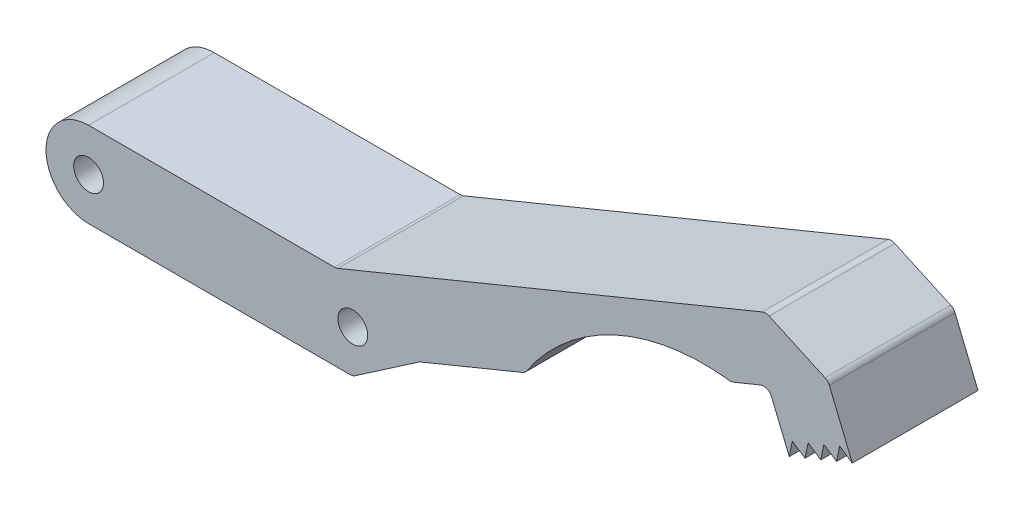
ISO-10303-21;
HEADER;
FILE_DESCRIPTION(('STEP AP214'),'2;1');
FILE_NAME('part.step','',(''),(''),'','','');
FILE_SCHEMA(('AUTOMOTIVE_DESIGN { 1 0 10303 214 1 1 1 1 }'));
ENDSEC;
DATA;
#1=APPLICATION_CONTEXT('core data for automotive mechanical design processes');
#2=APPLICATION_PROTOCOL_DEFINITION('international standard','automotive_design',2000,#1);
#3=PRODUCT_CONTEXT('',#1,'mechanical');
#4=PRODUCT('Part','Part','',(#3));
#5=PRODUCT_RELATED_PRODUCT_CATEGORY('part','',(#4));
#6=PRODUCT_DEFINITION_FORMATION('','',#4);
#7=PRODUCT_DEFINITION_CONTEXT('part definition',#1,'design');
#8=PRODUCT_DEFINITION('design','',#6,#7);
#9=PRODUCT_DEFINITION_SHAPE('','',#8);
#10=(LENGTH_UNIT() NAMED_UNIT(*) SI_UNIT(.MILLI.,.METRE.));
#11=(NAMED_UNIT(*) PLANE_ANGLE_UNIT() SI_UNIT($,.RADIAN.));
#12=(NAMED_UNIT(*) SI_UNIT($,.STERADIAN.) SOLID_ANGLE_UNIT());
#13=UNCERTAINTY_MEASURE_WITH_UNIT(LENGTH_MEASURE(1.E-05),#10,'distance_accuracy_value','');
#14=(GEOMETRIC_REPRESENTATION_CONTEXT(3) GLOBAL_UNCERTAINTY_ASSIGNED_CONTEXT((#13)) GLOBAL_UNIT_ASSIGNED_CONTEXT((#10,
#11,#12)) REPRESENTATION_CONTEXT('',''));
#15=CARTESIAN_POINT('',(0.,0.,0.));
#16=DIRECTION('',(0.,0.,1.));
#17=DIRECTION('',(1.,0.,0.));
#18=AXIS2_PLACEMENT_3D('',#15,#16,#17);
#19=CARTESIAN_POINT('',(4.18285581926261,-10.1735590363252,7.375));
#20=DIRECTION('',(0.380263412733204,-0.92487822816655,0.));
#21=DIRECTION('',(0.92487822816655,0.380263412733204,0.));
#22=AXIS2_PLACEMENT_3D('',#19,#20,#21);
#23=PLANE('',#22);
#24=DIRECTION('',(-0.92487822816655,-0.380263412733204,0.));
#25=VECTOR('',#24,1.);
#26=CARTESIAN_POINT('',(4.18285581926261,-10.1735590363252,-7.375));
#27=LINE('',#26,#25);
#28=CARTESIAN_POINT('',(41.9373455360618,5.34918835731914,-7.375));
#29=VERTEX_POINT('',#28);
#30=CARTESIAN_POINT('',(29.9516692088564,0.421281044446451,-7.375));
#31=VERTEX_POINT('',#30);
#32=EDGE_CURVE('E300',#29,#31,#27,.T.);
#33=ORIENTED_EDGE('',*,*,#32,.F.);
#34=DIRECTION('',(0.,0.,1.));
#35=VECTOR('',#34,1.);
#36=CARTESIAN_POINT('',(41.9373455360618,5.34918835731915,7.375));
#37=LINE('',#36,#35);
#38=CARTESIAN_POINT('',(41.9373455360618,5.34918835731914,7.375));
#39=VERTEX_POINT('',#38);
#40=EDGE_CURVE('E409',#29,#39,#37,.T.);
#41=ORIENTED_EDGE('',*,*,#40,.T.);
#42=DIRECTION('',(-0.92487822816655,-0.380263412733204,0.));
#43=VECTOR('',#42,1.);
#44=CARTESIAN_POINT('',(4.18285581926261,-10.1735590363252,7.375));
#45=LINE('',#44,#43);
#46=CARTESIAN_POINT('',(29.9516692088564,0.421281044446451,7.375));
#47=VERTEX_POINT('',#46);
#48=EDGE_CURVE('E449',#39,#47,#45,.T.);
#49=ORIENTED_EDGE('',*,*,#48,.T.);
#50=DIRECTION('',(0.,0.,-1.));
#51=VECTOR('',#50,1.);
#52=CARTESIAN_POINT('',(29.9516692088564,0.421281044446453,-7.375));
#53=LINE('',#52,#51);
#54=EDGE_CURVE('E406',#47,#31,#53,.T.);
#55=ORIENTED_EDGE('',*,*,#54,.T.);
#56=EDGE_LOOP('',(#33,#41,#49,#55));
#57=FACE_BOUND('',#56,.T.);
#58=ADVANCED_FACE('F41',(#57),#23,.T.);
#59=CARTESIAN_POINT('',(63.1527344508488,-8.10069108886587,7.375));
#60=DIRECTION('',(0.,0.,-1.));
#61=DIRECTION('',(-1.,0.,0.));
#62=AXIS2_PLACEMENT_3D('',#59,#60,#61);
#63=CYLINDRICAL_SURFACE('',#62,24.9423564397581);
#64=CARTESIAN_POINT('',(63.1527344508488,-8.10069108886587,-7.375));
#65=DIRECTION('',(0.,0.,1.));
#66=DIRECTION('',(1.,0.,0.));
#67=AXIS2_PLACEMENT_3D('',#64,#65,#66);
#68=CIRCLE('',#67,24.9423564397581);
#69=CARTESIAN_POINT('',(42.3895297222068,5.71996280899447,-7.375));
#70=VERTEX_POINT('',#69);
#71=CARTESIAN_POINT('',(66.1728326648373,16.6581487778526,-7.375));
#72=VERTEX_POINT('',#71);
#73=EDGE_CURVE('E303',#70,#72,#68,.F.);
#74=ORIENTED_EDGE('',*,*,#73,.T.);
#75=DIRECTION('',(0.,0.,-1.));
#76=VECTOR('',#75,1.);
#77=CARTESIAN_POINT('',(66.1728326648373,16.6581487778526,7.375));
#78=LINE('',#77,#76);
#79=CARTESIAN_POINT('',(66.1728326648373,16.6581487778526,7.375));
#80=VERTEX_POINT('',#79);
#81=EDGE_CURVE('E393',#72,#80,#78,.F.);
#82=ORIENTED_EDGE('',*,*,#81,.T.);
#83=CARTESIAN_POINT('',(63.1527344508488,-8.10069108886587,7.375));
#84=DIRECTION('',(0.,0.,1.));
#85=DIRECTION('',(1.,0.,0.));
#86=AXIS2_PLACEMENT_3D('',#83,#84,#85);
#87=CIRCLE('',#86,24.9423564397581);
#88=CARTESIAN_POINT('',(42.3895297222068,5.71996280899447,7.375));
#89=VERTEX_POINT('',#88);
#90=EDGE_CURVE('E252',#89,#80,#87,.F.);
#91=ORIENTED_EDGE('',*,*,#90,.F.);
#92=DIRECTION('',(0.,0.,-1.));
#93=VECTOR('',#92,1.);
#94=CARTESIAN_POINT('',(42.3895297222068,5.71996280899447,7.375));
#95=LINE('',#94,#93);
#96=EDGE_CURVE('E390',#89,#70,#95,.T.);
#97=ORIENTED_EDGE('',*,*,#96,.T.);
#98=EDGE_LOOP('',(#74,#82,#91,#97));
#99=FACE_BOUND('',#98,.T.);
#100=ADVANCED_FACE('F488',(#99),#63,.F.);
#101=CARTESIAN_POINT('',(3.75864457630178,-9.14179071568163,7.375));
#102=DIRECTION('',(0.380263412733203,-0.924878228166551,0.));
#103=DIRECTION('',(0.924878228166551,0.380263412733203,0.));
#104=AXIS2_PLACEMENT_3D('',#101,#102,#103);
#105=PLANE('',#104);
#106=DIRECTION('',(-0.924878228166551,-0.380263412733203,0.));
#107=VECTOR('',#106,1.);
#108=CARTESIAN_POINT('',(3.75864457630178,-9.14179071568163,7.375));
#109=LINE('',#108,#107);
#110=CARTESIAN_POINT('',(69.8366856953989,18.0261765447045,7.375));
#111=VERTEX_POINT('',#110);
#112=CARTESIAN_POINT('',(66.6741791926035,16.7259129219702,7.375));
#113=VERTEX_POINT('',#112);
#114=EDGE_CURVE('E249',#111,#113,#109,.T.);
#115=ORIENTED_EDGE('',*,*,#114,.T.);
#116=DIRECTION('',(0.,0.,1.));
#117=VECTOR('',#116,1.);
#118=CARTESIAN_POINT('',(66.6741791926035,16.7259129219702,-7.375));
#119=LINE('',#118,#117);
#120=CARTESIAN_POINT('',(66.6741791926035,16.7259129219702,-7.375));
#121=VERTEX_POINT('',#120);
#122=EDGE_CURVE('E377',#113,#121,#119,.F.);
#123=ORIENTED_EDGE('',*,*,#122,.T.);
#124=DIRECTION('',(-0.924878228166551,-0.380263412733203,0.));
#125=VECTOR('',#124,1.);
#126=CARTESIAN_POINT('',(3.75864457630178,-9.14179071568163,-7.375));
#127=LINE('',#126,#125);
#128=CARTESIAN_POINT('',(69.8366856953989,18.0261765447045,-7.375));
#129=VERTEX_POINT('',#128);
#130=EDGE_CURVE('E306',#129,#121,#127,.T.);
#131=ORIENTED_EDGE('',*,*,#130,.F.);
#132=DIRECTION('',(0.,0.,-1.));
#133=VECTOR('',#132,1.);
#134=CARTESIAN_POINT('',(69.8366856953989,18.0261765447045,7.375));
#135=LINE('',#134,#133);
#136=EDGE_CURVE('E233',#129,#111,#135,.F.);
#137=ORIENTED_EDGE('',*,*,#136,.T.);
#138=EDGE_LOOP('',(#115,#123,#131,#137));
#139=FACE_BOUND('',#138,.T.);
#140=ADVANCED_FACE('F493',(#139),#105,.T.);
#141=CARTESIAN_POINT('',(67.0029193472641,27.5482306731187,7.375));
#142=DIRECTION('',(-0.924878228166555,-0.380263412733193,0.));
#143=DIRECTION('',(0.380263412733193,-0.924878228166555,0.));
#144=AXIS2_PLACEMENT_3D('',#141,#142,#143);
#145=PLANE('',#144);
#146=DIRECTION('',(-0.380263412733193,0.924878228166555,0.));
#147=VECTOR('',#146,1.);
#148=CARTESIAN_POINT('',(67.0029193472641,27.5482306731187,7.375));
#149=LINE('',#148,#147);
#150=CARTESIAN_POINT('',(73.2163573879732,12.4358812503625,7.375));
#151=VERTEX_POINT('',#150);
#152=CARTESIAN_POINT('',(71.1418273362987,17.4815617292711,7.375));
#153=VERTEX_POINT('',#152);
#154=EDGE_CURVE('E226',#151,#153,#149,.T.);
#155=ORIENTED_EDGE('',*,*,#154,.T.);
#156=DIRECTION('',(0.,0.,-1.));
#157=VECTOR('',#156,1.);
#158=CARTESIAN_POINT('',(71.1418273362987,17.4815617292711,-7.375));
#159=LINE('',#158,#157);
#160=CARTESIAN_POINT('',(71.1418273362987,17.4815617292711,-7.375));
#161=VERTEX_POINT('',#160);
#162=EDGE_CURVE('E404',#153,#161,#159,.T.);
#163=ORIENTED_EDGE('',*,*,#162,.T.);
#164=DIRECTION('',(-0.380263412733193,0.924878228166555,0.));
#165=VECTOR('',#164,1.);
#166=CARTESIAN_POINT('',(67.0029193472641,27.5482306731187,-7.375));
#167=LINE('',#166,#165);
#168=CARTESIAN_POINT('',(73.2163573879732,12.4358812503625,-7.375));
#169=VERTEX_POINT('',#168);
#170=EDGE_CURVE('E229',#169,#161,#167,.T.);
#171=ORIENTED_EDGE('',*,*,#170,.F.);
#172=DIRECTION('',(0.,0.,-1.));
#173=VECTOR('',#172,1.);
#174=CARTESIAN_POINT('',(73.2163573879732,12.4358812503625,7.375));
#175=LINE('',#174,#173);
#176=EDGE_CURVE('E221',#151,#169,#175,.T.);
#177=ORIENTED_EDGE('',*,*,#176,.F.);
#178=EDGE_LOOP('',(#155,#163,#171,#177));
#179=FACE_BOUND('',#178,.T.);
#180=ADVANCED_FACE('F223',(#179),#145,.T.);
#181=CARTESIAN_POINT('',(67.8333487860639,-13.8770907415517,7.375));
#182=DIRECTION('',(-0.979709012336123,0.200425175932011,0.));
#183=DIRECTION('',(-0.200425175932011,-0.979709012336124,0.));
#184=AXIS2_PLACEMENT_3D('',#181,#182,#183);
#185=PLANE('',#184);
#186=DIRECTION('',(0.200425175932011,0.979709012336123,0.));
#187=VECTOR('',#186,1.);
#188=CARTESIAN_POINT('',(67.8333487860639,-13.8770907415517,-7.375));
#189=LINE('',#188,#187);
#190=CARTESIAN_POINT('',(73.575596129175,14.1918953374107,-7.375));
#191=VERTEX_POINT('',#190);
#192=EDGE_CURVE('E310',#169,#191,#189,.T.);
#193=ORIENTED_EDGE('',*,*,#192,.T.);
#194=DIRECTION('',(0.,0.,-1.));
#195=VECTOR('',#194,1.);
#196=CARTESIAN_POINT('',(73.575596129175,14.1918953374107,7.375));
#197=LINE('',#196,#195);
#198=CARTESIAN_POINT('',(73.575596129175,14.1918953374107,7.375));
#199=VERTEX_POINT('',#198);
#200=EDGE_CURVE('E234',#199,#191,#197,.T.);
#201=ORIENTED_EDGE('',*,*,#200,.F.);
#202=DIRECTION('',(0.200425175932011,0.979709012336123,0.));
#203=VECTOR('',#202,1.);
#204=CARTESIAN_POINT('',(67.8333487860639,-13.8770907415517,7.375));
#205=LINE('',#204,#203);
#206=EDGE_CURVE('E238',#151,#199,#205,.T.);
#207=ORIENTED_EDGE('',*,*,#206,.F.);
#208=ORIENTED_EDGE('',*,*,#176,.T.);
#209=EDGE_LOOP('',(#193,#201,#207,#208));
#210=FACE_BOUND('',#209,.T.);
#211=ADVANCED_FACE('F239',(#210),#185,.F.);
#212=CARTESIAN_POINT('',(29.2503710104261,43.7958353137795,7.375));
#213=DIRECTION('',(0.555398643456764,0.831584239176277,0.));
#214=DIRECTION('',(-0.831584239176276,0.555398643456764,0.));
#215=AXIS2_PLACEMENT_3D('',#212,#213,#214);
#216=PLANE('',#215);
#217=DIRECTION('',(0.831584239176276,-0.555398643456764,0.));
#218=VECTOR('',#217,1.);
#219=CARTESIAN_POINT('',(29.2503710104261,43.7958353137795,-7.375));
#220=LINE('',#219,#218);
#221=CARTESIAN_POINT('',(75.0661138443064,13.1964080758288,-7.375));
#222=VERTEX_POINT('',#221);
#223=EDGE_CURVE('E312',#191,#222,#220,.T.);
#224=ORIENTED_EDGE('',*,*,#223,.T.);
#225=DIRECTION('',(0.,0.,-1.));
#226=VECTOR('',#225,1.);
#227=CARTESIAN_POINT('',(75.0661138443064,13.1964080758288,7.375));
#228=LINE('',#227,#226);
#229=CARTESIAN_POINT('',(75.0661138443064,13.1964080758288,7.375));
#230=VERTEX_POINT('',#229);
#231=EDGE_CURVE('E372',#230,#222,#228,.T.);
#232=ORIENTED_EDGE('',*,*,#231,.F.);
#233=DIRECTION('',(0.831584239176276,-0.555398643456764,0.));
#234=VECTOR('',#233,1.);
#235=CARTESIAN_POINT('',(29.2503710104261,43.7958353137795,7.375));
#236=LINE('',#235,#234);
#237=EDGE_CURVE('E242',#199,#230,#236,.T.);
#238=ORIENTED_EDGE('',*,*,#237,.F.);
#239=ORIENTED_EDGE('',*,*,#200,.T.);
#240=EDGE_LOOP('',(#224,#232,#238,#239));
#241=FACE_BOUND('',#240,.T.);
#242=ADVANCED_FACE('F581',(#241),#216,.F.);
#243=CARTESIAN_POINT('',(69.4594642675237,-14.2097553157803,7.375));
#244=DIRECTION('',(-0.979709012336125,0.200425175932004,0.));
#245=DIRECTION('',(-0.200425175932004,-0.979709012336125,0.));
#246=AXIS2_PLACEMENT_3D('',#243,#244,#245);
#247=PLANE('',#246);
#248=DIRECTION('',(0.200425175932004,0.979709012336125,0.));
#249=VECTOR('',#248,1.);
#250=CARTESIAN_POINT('',(69.4594642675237,-14.2097553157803,-7.375));
#251=LINE('',#250,#249);
#252=CARTESIAN_POINT('',(75.4253525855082,14.952422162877,-7.375));
#253=VERTEX_POINT('',#252);
#254=EDGE_CURVE('E315',#222,#253,#251,.T.);
#255=ORIENTED_EDGE('',*,*,#254,.T.);
#256=DIRECTION('',(0.,0.,-1.));
#257=VECTOR('',#256,1.);
#258=CARTESIAN_POINT('',(75.4253525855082,14.952422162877,7.375));
#259=LINE('',#258,#257);
#260=CARTESIAN_POINT('',(75.4253525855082,14.952422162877,7.375));
#261=VERTEX_POINT('',#260);
#262=EDGE_CURVE('E370',#261,#253,#259,.T.);
#263=ORIENTED_EDGE('',*,*,#262,.F.);
#264=DIRECTION('',(0.200425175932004,0.979709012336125,0.));
#265=VECTOR('',#264,1.);
#266=CARTESIAN_POINT('',(69.4594642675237,-14.2097553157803,7.375));
#267=LINE('',#266,#265);
#268=EDGE_CURVE('E257',#230,#261,#267,.T.);
#269=ORIENTED_EDGE('',*,*,#268,.F.);
#270=ORIENTED_EDGE('',*,*,#231,.T.);
#271=EDGE_LOOP('',(#255,#263,#269,#270));
#272=FACE_BOUND('',#271,.T.);
#273=ADVANCED_FACE('F578',(#272),#247,.F.);
#274=CARTESIAN_POINT('',(30.1722185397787,45.1760941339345,7.375));
#275=DIRECTION('',(-0.555398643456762,-0.831584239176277,0.));
#276=DIRECTION('',(0.831584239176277,-0.555398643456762,0.));
#277=AXIS2_PLACEMENT_3D('',#274,#275,#276);
#278=PLANE('',#277);
#279=DIRECTION('',(-0.831584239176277,0.555398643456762,0.));
#280=VECTOR('',#279,1.);
#281=CARTESIAN_POINT('',(30.1722185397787,45.1760941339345,-7.375));
#282=LINE('',#281,#280);
#283=CARTESIAN_POINT('',(76.9158703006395,13.9569349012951,-7.375));
#284=VERTEX_POINT('',#283);
#285=EDGE_CURVE('E318',#284,#253,#282,.T.);
#286=ORIENTED_EDGE('',*,*,#285,.F.);
#287=DIRECTION('',(0.,0.,-1.));
#288=VECTOR('',#287,1.);
#289=CARTESIAN_POINT('',(76.9158703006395,13.9569349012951,7.375));
#290=LINE('',#289,#288);
#291=CARTESIAN_POINT('',(76.9158703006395,13.9569349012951,7.375));
#292=VERTEX_POINT('',#291);
#293=EDGE_CURVE('E368',#292,#284,#290,.T.);
#294=ORIENTED_EDGE('',*,*,#293,.F.);
#295=DIRECTION('',(-0.831584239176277,0.555398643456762,0.));
#296=VECTOR('',#295,1.);
#297=CARTESIAN_POINT('',(30.1722185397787,45.1760941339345,7.375));
#298=LINE('',#297,#296);
#299=EDGE_CURVE('E259',#292,#261,#298,.T.);
#300=ORIENTED_EDGE('',*,*,#299,.T.);
#301=ORIENTED_EDGE('',*,*,#262,.T.);
#302=EDGE_LOOP('',(#286,#294,#300,#301));
#303=FACE_BOUND('',#302,.T.);
#304=ADVANCED_FACE('F575',(#303),#278,.T.);
#305=CARTESIAN_POINT('',(71.0855797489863,-14.5424198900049,7.375));
#306=DIRECTION('',(0.979709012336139,-0.200425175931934,0.));
#307=DIRECTION('',(0.200425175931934,0.979709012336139,0.));
#308=AXIS2_PLACEMENT_3D('',#305,#306,#307);
#309=PLANE('',#308);
#310=DIRECTION('',(-0.200425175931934,-0.979709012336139,0.));
#311=VECTOR('',#310,1.);
#312=CARTESIAN_POINT('',(71.0855797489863,-14.5424198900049,-7.375));
#313=LINE('',#312,#311);
#314=CARTESIAN_POINT('',(77.2751090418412,15.7129489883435,-7.375));
#315=VERTEX_POINT('',#314);
#316=EDGE_CURVE('E321',#315,#284,#313,.T.);
#317=ORIENTED_EDGE('',*,*,#316,.F.);
#318=DIRECTION('',(0.,0.,-1.));
#319=VECTOR('',#318,1.);
#320=CARTESIAN_POINT('',(77.2751090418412,15.7129489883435,7.375));
#321=LINE('',#320,#319);
#322=CARTESIAN_POINT('',(77.2751090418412,15.7129489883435,7.375));
#323=VERTEX_POINT('',#322);
#324=EDGE_CURVE('E366',#323,#315,#321,.T.);
#325=ORIENTED_EDGE('',*,*,#324,.F.);
#326=DIRECTION('',(-0.200425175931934,-0.979709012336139,0.));
#327=VECTOR('',#326,1.);
#328=CARTESIAN_POINT('',(71.0855797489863,-14.5424198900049,7.375));
#329=LINE('',#328,#327);
#330=EDGE_CURVE('E262',#323,#292,#329,.T.);
#331=ORIENTED_EDGE('',*,*,#330,.T.);
#332=ORIENTED_EDGE('',*,*,#293,.T.);
#333=EDGE_LOOP('',(#317,#325,#331,#332));
#334=FACE_BOUND('',#333,.T.);
#335=ADVANCED_FACE('F571',(#334),#309,.T.);
#336=CARTESIAN_POINT('',(31.0940660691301,46.5563529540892,7.375));
#337=DIRECTION('',(-0.555398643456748,-0.831584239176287,0.));
#338=DIRECTION('',(0.831584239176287,-0.555398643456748,0.));
#339=AXIS2_PLACEMENT_3D('',#336,#337,#338);
#340=PLANE('',#339);
#341=DIRECTION('',(-0.831584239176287,0.555398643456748,0.));
#342=VECTOR('',#341,1.);
#343=CARTESIAN_POINT('',(31.0940660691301,46.5563529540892,-7.375));
#344=LINE('',#343,#342);
#345=CARTESIAN_POINT('',(78.7656267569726,14.7174617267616,-7.375));
#346=VERTEX_POINT('',#345);
#347=EDGE_CURVE('E324',#346,#315,#344,.T.);
#348=ORIENTED_EDGE('',*,*,#347,.F.);
#349=DIRECTION('',(0.,0.,-1.));
#350=VECTOR('',#349,1.);
#351=CARTESIAN_POINT('',(78.7656267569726,14.7174617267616,7.375));
#352=LINE('',#351,#350);
#353=CARTESIAN_POINT('',(78.7656267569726,14.7174617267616,7.375));
#354=VERTEX_POINT('',#353);
#355=EDGE_CURVE('E364',#354,#346,#352,.T.);
#356=ORIENTED_EDGE('',*,*,#355,.F.);
#357=DIRECTION('',(-0.831584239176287,0.555398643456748,0.));
#358=VECTOR('',#357,1.);
#359=CARTESIAN_POINT('',(31.0940660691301,46.5563529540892,7.375));
#360=LINE('',#359,#358);
#361=EDGE_CURVE('E265',#354,#323,#360,.T.);
#362=ORIENTED_EDGE('',*,*,#361,.T.);
#363=ORIENTED_EDGE('',*,*,#324,.T.);
#364=EDGE_LOOP('',(#348,#356,#362,#363));
#365=FACE_BOUND('',#364,.T.);
#366=ADVANCED_FACE('F567',(#365),#340,.T.);
#367=CARTESIAN_POINT('',(72.7116952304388,-14.8750844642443,7.375));
#368=DIRECTION('',(0.979709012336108,-0.200425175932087,0.));
#369=DIRECTION('',(0.200425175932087,0.979709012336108,0.));
#370=AXIS2_PLACEMENT_3D('',#367,#368,#369);
#371=PLANE('',#370);
#372=DIRECTION('',(-0.200425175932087,-0.979709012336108,0.));
#373=VECTOR('',#372,1.);
#374=CARTESIAN_POINT('',(72.7116952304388,-14.8750844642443,-7.375));
#375=LINE('',#374,#373);
#376=CARTESIAN_POINT('',(79.1248654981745,16.4734758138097,-7.375));
#377=VERTEX_POINT('',#376);
#378=EDGE_CURVE('E327',#377,#346,#375,.T.);
#379=ORIENTED_EDGE('',*,*,#378,.F.);
#380=DIRECTION('',(0.,0.,-1.));
#381=VECTOR('',#380,1.);
#382=CARTESIAN_POINT('',(79.1248654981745,16.4734758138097,7.375));
#383=LINE('',#382,#381);
#384=CARTESIAN_POINT('',(79.1248654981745,16.4734758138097,7.375));
#385=VERTEX_POINT('',#384);
#386=EDGE_CURVE('E362',#385,#377,#383,.T.);
#387=ORIENTED_EDGE('',*,*,#386,.F.);
#388=DIRECTION('',(-0.200425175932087,-0.979709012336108,0.));
#389=VECTOR('',#388,1.);
#390=CARTESIAN_POINT('',(72.7116952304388,-14.8750844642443,7.375));
#391=LINE('',#390,#389);
#392=EDGE_CURVE('E268',#385,#354,#391,.T.);
#393=ORIENTED_EDGE('',*,*,#392,.T.);
#394=ORIENTED_EDGE('',*,*,#355,.T.);
#395=EDGE_LOOP('',(#379,#387,#393,#394));
#396=FACE_BOUND('',#395,.T.);
#397=ADVANCED_FACE('F562',(#396),#371,.T.);
#398=CARTESIAN_POINT('',(32.0159135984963,47.9366117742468,7.375));
#399=DIRECTION('',(0.555398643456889,0.831584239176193,0.));
#400=DIRECTION('',(-0.831584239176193,0.555398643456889,0.));
#401=AXIS2_PLACEMENT_3D('',#398,#399,#400);
#402=PLANE('',#401);
#403=DIRECTION('',(0.831584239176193,-0.555398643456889,0.));
#404=VECTOR('',#403,1.);
#405=CARTESIAN_POINT('',(32.0159135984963,47.9366117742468,-7.375));
#406=LINE('',#405,#404);
#407=CARTESIAN_POINT('',(80.6153832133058,15.4779885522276,-7.375));
#408=VERTEX_POINT('',#407);
#409=EDGE_CURVE('E330',#377,#408,#406,.T.);
#410=ORIENTED_EDGE('',*,*,#409,.T.);
#411=DIRECTION('',(0.,0.,-1.));
#412=VECTOR('',#411,1.);
#413=CARTESIAN_POINT('',(80.6153832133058,15.4779885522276,7.375));
#414=LINE('',#413,#412);
#415=CARTESIAN_POINT('',(80.6153832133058,15.4779885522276,7.375));
#416=VERTEX_POINT('',#415);
#417=EDGE_CURVE('E359',#416,#408,#414,.T.);
#418=ORIENTED_EDGE('',*,*,#417,.F.);
#419=DIRECTION('',(0.831584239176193,-0.555398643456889,0.));
#420=VECTOR('',#419,1.);
#421=CARTESIAN_POINT('',(32.0159135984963,47.9366117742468,7.375));
#422=LINE('',#421,#420);
#423=EDGE_CURVE('E271',#385,#416,#422,.T.);
#424=ORIENTED_EDGE('',*,*,#423,.F.);
#425=ORIENTED_EDGE('',*,*,#386,.T.);
#426=EDGE_LOOP('',(#410,#418,#424,#425));
#427=FACE_BOUND('',#426,.T.);
#428=ADVANCED_FACE('F559',(#427),#402,.F.);
#429=CARTESIAN_POINT('',(74.4019451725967,30.5903379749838,7.375));
#430=DIRECTION('',(-0.924878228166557,-0.380263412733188,0.));
#431=DIRECTION('',(0.380263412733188,-0.924878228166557,0.));
#432=AXIS2_PLACEMENT_3D('',#429,#430,#431);
#433=PLANE('',#432);
#434=DIRECTION('',(-0.380263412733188,0.924878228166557,0.));
#435=VECTOR('',#434,1.);
#436=CARTESIAN_POINT('',(74.4019451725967,30.5903379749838,-7.375));
#437=LINE('',#436,#435);
#438=CARTESIAN_POINT('',(77.923325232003,22.0256229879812,-7.375));
#439=VERTEX_POINT('',#438);
#440=EDGE_CURVE('E333',#408,#439,#437,.T.);
#441=ORIENTED_EDGE('',*,*,#440,.T.);
#442=DIRECTION('',(0.,0.,-1.));
#443=VECTOR('',#442,1.);
#444=CARTESIAN_POINT('',(77.923325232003,22.0256229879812,7.375));
#445=LINE('',#444,#443);
#446=CARTESIAN_POINT('',(77.923325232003,22.0256229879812,7.375));
#447=VERTEX_POINT('',#446);
#448=EDGE_CURVE('E424',#439,#447,#445,.F.);
#449=ORIENTED_EDGE('',*,*,#448,.T.);
#450=DIRECTION('',(-0.380263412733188,0.924878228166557,0.));
#451=VECTOR('',#450,1.);
#452=CARTESIAN_POINT('',(74.4019451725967,30.5903379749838,7.375));
#453=LINE('',#452,#451);
#454=EDGE_CURVE('E274',#416,#447,#453,.T.);
#455=ORIENTED_EDGE('',*,*,#454,.F.);
#456=ORIENTED_EDGE('',*,*,#417,.T.);
#457=EDGE_LOOP('',(#441,#449,#455,#456));
#458=FACE_BOUND('',#457,.T.);
#459=ADVANCED_FACE('F555',(#458),#433,.F.);
#460=CARTESIAN_POINT('',(21.8103769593,47.8823439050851,7.375));
#461=DIRECTION('',(0.414522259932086,0.910039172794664,0.));
#462=DIRECTION('',(-0.910039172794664,0.414522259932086,0.));
#463=AXIS2_PLACEMENT_3D('',#460,#461,#462);
#464=PLANE('',#463);
#465=DIRECTION('',(0.910039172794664,-0.414522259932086,0.));
#466=VECTOR('',#465,1.);
#467=CARTESIAN_POINT('',(21.8103769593,47.8823439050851,7.375));
#468=LINE('',#467,#466);
#469=CARTESIAN_POINT('',(70.8500425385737,25.54480766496,7.375));
#470=VERTEX_POINT('',#469);
#471=CARTESIAN_POINT('',(77.4129692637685,22.5553987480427,7.375));
#472=VERTEX_POINT('',#471);
#473=EDGE_CURVE('E277',#470,#472,#468,.T.);
#474=ORIENTED_EDGE('',*,*,#473,.T.);
#475=DIRECTION('',(0.,0.,-1.));
#476=VECTOR('',#475,1.);
#477=CARTESIAN_POINT('',(77.4129692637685,22.5553987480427,-7.375));
#478=LINE('',#477,#476);
#479=CARTESIAN_POINT('',(77.4129692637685,22.5553987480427,-7.375));
#480=VERTEX_POINT('',#479);
#481=EDGE_CURVE('E421',#472,#480,#478,.T.);
#482=ORIENTED_EDGE('',*,*,#481,.T.);
#483=DIRECTION('',(0.910039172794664,-0.414522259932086,0.));
#484=VECTOR('',#483,1.);
#485=CARTESIAN_POINT('',(21.8103769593,47.8823439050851,-7.375));
#486=LINE('',#485,#484);
#487=CARTESIAN_POINT('',(70.8500425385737,25.54480766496,-7.375));
#488=VERTEX_POINT('',#487);
#489=EDGE_CURVE('E336',#488,#480,#486,.T.);
#490=ORIENTED_EDGE('',*,*,#489,.F.);
#491=DIRECTION('',(0.,0.,-1.));
#492=VECTOR('',#491,1.);
#493=CARTESIAN_POINT('',(70.8500425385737,25.54480766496,7.375));
#494=LINE('',#493,#492);
#495=EDGE_CURVE('E419',#488,#470,#494,.F.);
#496=ORIENTED_EDGE('',*,*,#495,.T.);
#497=EDGE_LOOP('',(#474,#482,#490,#496));
#498=FACE_BOUND('',#497,.T.);
#499=ADVANCED_FACE('F548',(#498),#464,.T.);
#500=CARTESIAN_POINT('',(1.14074851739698,-2.7745332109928,7.375));
#501=DIRECTION('',(-0.380263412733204,0.92487822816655,0.));
#502=DIRECTION('',(-0.92487822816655,-0.380263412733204,0.));
#503=AXIS2_PLACEMENT_3D('',#500,#501,#502);
#504=PLANE('',#503);
#505=DIRECTION('',(0.92487822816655,0.380263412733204,0.));
#506=VECTOR('',#505,1.);
#507=CARTESIAN_POINT('',(1.14074851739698,-2.7745332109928,-7.375));
#508=LINE('',#507,#506);
#509=CARTESIAN_POINT('',(20.2327114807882,5.07512177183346,-7.375));
#510=VERTEX_POINT('',#509);
#511=CARTESIAN_POINT('',(70.0552568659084,25.5596467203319,-7.375));
#512=VERTEX_POINT('',#511);
#513=EDGE_CURVE('E339',#510,#512,#508,.T.);
#514=ORIENTED_EDGE('',*,*,#513,.F.);
#515=DIRECTION('',(0.,0.,-1.));
#516=VECTOR('',#515,1.);
#517=CARTESIAN_POINT('',(20.2327114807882,5.07512177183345,7.375));
#518=LINE('',#517,#516);
#519=CARTESIAN_POINT('',(20.2327114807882,5.07512177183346,7.375));
#520=VERTEX_POINT('',#519);
#521=EDGE_CURVE('E417',#510,#520,#518,.F.);
#522=ORIENTED_EDGE('',*,*,#521,.T.);
#523=DIRECTION('',(0.92487822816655,0.380263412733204,0.));
#524=VECTOR('',#523,1.);
#525=CARTESIAN_POINT('',(1.14074851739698,-2.7745332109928,7.375));
#526=LINE('',#525,#524);
#527=CARTESIAN_POINT('',(70.0552568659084,25.5596467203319,7.375));
#528=VERTEX_POINT('',#527);
#529=EDGE_CURVE('E280',#520,#528,#526,.T.);
#530=ORIENTED_EDGE('',*,*,#529,.T.);
#531=DIRECTION('',(0.,0.,-1.));
#532=VECTOR('',#531,1.);
#533=CARTESIAN_POINT('',(70.0552568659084,25.5596467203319,7.375));
#534=LINE('',#533,#532);
#535=EDGE_CURVE('E414',#528,#512,#534,.T.);
#536=ORIENTED_EDGE('',*,*,#535,.T.);
#537=EDGE_LOOP('',(#514,#522,#530,#536));
#538=FACE_BOUND('',#537,.T.);
#539=ADVANCED_FACE('F541',(#538),#504,.T.);
#540=CARTESIAN_POINT('',(0.,5.,7.375));
#541=DIRECTION('',(0.,1.,0.));
#542=DIRECTION('',(-1.,0.,0.));
#543=AXIS2_PLACEMENT_3D('',#540,#541,#542);
#544=PLANE('',#543);
#545=DIRECTION('',(1.,0.,0.));
#546=VECTOR('',#545,1.);
#547=CARTESIAN_POINT('',(0.,5.,7.375));
#548=LINE('',#547,#546);
#549=CARTESIAN_POINT('',(-9.,5.,7.375));
#550=VERTEX_POINT('',#549);
#551=CARTESIAN_POINT('',(19.852448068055,5.,7.375));
#552=VERTEX_POINT('',#551);
#553=EDGE_CURVE('E283',#550,#552,#548,.T.);
#554=ORIENTED_EDGE('',*,*,#553,.T.);
#555=DIRECTION('',(0.,0.,-1.));
#556=VECTOR('',#555,1.);
#557=CARTESIAN_POINT('',(19.852448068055,5.,-7.375));
#558=LINE('',#557,#556);
#559=CARTESIAN_POINT('',(19.852448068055,5.,-7.375));
#560=VERTEX_POINT('',#559);
#561=EDGE_CURVE('E411',#552,#560,#558,.T.);
#562=ORIENTED_EDGE('',*,*,#561,.T.);
#563=DIRECTION('',(1.,0.,0.));
#564=VECTOR('',#563,1.);
#565=CARTESIAN_POINT('',(0.,5.,-7.375));
#566=LINE('',#565,#564);
#567=CARTESIAN_POINT('',(-9.,5.,-7.375));
#568=VERTEX_POINT('',#567);
#569=EDGE_CURVE('E342',#568,#560,#566,.T.);
#570=ORIENTED_EDGE('',*,*,#569,.F.);
#571=DIRECTION('',(0.,0.,-1.));
#572=VECTOR('',#571,1.);
#573=CARTESIAN_POINT('',(-9.,5.,7.375));
#574=LINE('',#573,#572);
#575=EDGE_CURVE('E357',#550,#568,#574,.T.);
#576=ORIENTED_EDGE('',*,*,#575,.F.);
#577=EDGE_LOOP('',(#554,#562,#570,#576));
#578=FACE_BOUND('',#577,.T.);
#579=ADVANCED_FACE('F534',(#578),#544,.T.);
#580=CARTESIAN_POINT('',(-9.,0.,7.375));
#581=DIRECTION('',(0.,0.,-1.));
#582=DIRECTION('',(-1.,0.,0.));
#583=AXIS2_PLACEMENT_3D('',#580,#581,#582);
#584=CYLINDRICAL_SURFACE('',#583,5.);
#585=CARTESIAN_POINT('',(-9.,0.,-7.375));
#586=DIRECTION('',(0.,0.,1.));
#587=DIRECTION('',(1.,0.,0.));
#588=AXIS2_PLACEMENT_3D('',#585,#586,#587);
#589=CIRCLE('',#588,5.);
#590=CARTESIAN_POINT('',(-9.,-5.,-7.375));
#591=VERTEX_POINT('',#590);
#592=EDGE_CURVE('E345',#568,#591,#589,.T.);
#593=ORIENTED_EDGE('',*,*,#592,.T.);
#594=DIRECTION('',(0.,0.,-1.));
#595=VECTOR('',#594,1.);
#596=CARTESIAN_POINT('',(-9.,-5.,7.375));
#597=LINE('',#596,#595);
#598=CARTESIAN_POINT('',(-9.,-5.,7.375));
#599=VERTEX_POINT('',#598);
#600=EDGE_CURVE('E293',#599,#591,#597,.T.);
#601=ORIENTED_EDGE('',*,*,#600,.F.);
#602=CARTESIAN_POINT('',(-9.,0.,7.375));
#603=DIRECTION('',(0.,0.,1.));
#604=DIRECTION('',(1.,0.,0.));
#605=AXIS2_PLACEMENT_3D('',#602,#603,#604);
#606=CIRCLE('',#605,5.);
#607=EDGE_CURVE('E286',#550,#599,#606,.T.);
#608=ORIENTED_EDGE('',*,*,#607,.F.);
#609=ORIENTED_EDGE('',*,*,#575,.T.);
#610=EDGE_LOOP('',(#593,#601,#608,#609));
#611=FACE_BOUND('',#610,.T.);
#612=ADVANCED_FACE('F531',(#611),#584,.T.);
#613=CARTESIAN_POINT('',(0.,-5.,7.375));
#614=DIRECTION('',(0.,1.,0.));
#615=DIRECTION('',(-1.,0.,0.));
#616=AXIS2_PLACEMENT_3D('',#613,#614,#615);
#617=PLANE('',#616);
#618=DIRECTION('',(1.,0.,0.));
#619=VECTOR('',#618,1.);
#620=CARTESIAN_POINT('',(0.,-5.,-7.375));
#621=LINE('',#620,#619);
#622=CARTESIAN_POINT('',(21.6902867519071,-5.,-7.375));
#623=VERTEX_POINT('',#622);
#624=EDGE_CURVE('E348',#591,#623,#621,.T.);
#625=ORIENTED_EDGE('',*,*,#624,.T.);
#626=DIRECTION('',(0.,0.,-1.));
#627=VECTOR('',#626,1.);
#628=CARTESIAN_POINT('',(21.6902867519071,-5.,7.375));
#629=LINE('',#628,#627);
#630=CARTESIAN_POINT('',(21.6902867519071,-5.,7.375));
#631=VERTEX_POINT('',#630);
#632=EDGE_CURVE('E430',#623,#631,#629,.F.);
#633=ORIENTED_EDGE('',*,*,#632,.T.);
#634=DIRECTION('',(1.,0.,0.));
#635=VECTOR('',#634,1.);
#636=CARTESIAN_POINT('',(0.,-5.,7.375));
#637=LINE('',#636,#635);
#638=EDGE_CURVE('E289',#599,#631,#637,.T.);
#639=ORIENTED_EDGE('',*,*,#638,.F.);
#640=ORIENTED_EDGE('',*,*,#600,.T.);
#641=EDGE_LOOP('',(#625,#633,#639,#640));
#642=FACE_BOUND('',#641,.T.);
#643=ADVANCED_FACE('F472',(#642),#617,.F.);
#644=CARTESIAN_POINT('',(22.,0.,7.375));
#645=DIRECTION('',(0.,0.,-1.));
#646=DIRECTION('',(-1.,0.,0.));
#647=AXIS2_PLACEMENT_3D('',#644,#645,#646);
#648=CYLINDRICAL_SURFACE('',#647,1.75);
#649=CARTESIAN_POINT('',(22.,0.,7.375));
#650=DIRECTION('',(0.,0.,1.));
#651=DIRECTION('',(1.,0.,0.));
#652=AXIS2_PLACEMENT_3D('',#649,#650,#651);
#653=CIRCLE('',#652,1.75);
#654=CARTESIAN_POINT('',(23.75,0.,7.375));
#655=VERTEX_POINT('',#654);
#656=EDGE_CURVE('E453',#655,#655,#653,.T.);
#657=ORIENTED_EDGE('',*,*,#656,.T.);
#658=EDGE_LOOP('',(#657));
#659=FACE_BOUND('',#658,.T.);
#660=CARTESIAN_POINT('',(22.,0.,-7.375));
#661=DIRECTION('',(0.,0.,1.));
#662=DIRECTION('',(1.,0.,0.));
#663=AXIS2_PLACEMENT_3D('',#660,#661,#662);
#664=CIRCLE('',#663,1.75);
#665=CARTESIAN_POINT('',(23.75,0.,-7.375));
#666=VERTEX_POINT('',#665);
#667=EDGE_CURVE('E297',#666,#666,#664,.T.);
#668=ORIENTED_EDGE('',*,*,#667,.F.);
#669=EDGE_LOOP('',(#668));
#670=FACE_BOUND('',#669,.T.);
#671=ADVANCED_FACE('F469',(#659,#670),#648,.F.);
#672=CARTESIAN_POINT('',(-9.,0.,7.375));
#673=DIRECTION('',(0.,0.,-1.));
#674=DIRECTION('',(-1.,0.,0.));
#675=AXIS2_PLACEMENT_3D('',#672,#673,#674);
#676=CYLINDRICAL_SURFACE('',#675,1.75);
#677=CARTESIAN_POINT('',(-9.,0.,7.375));
#678=DIRECTION('',(0.,0.,1.));
#679=DIRECTION('',(1.,0.,0.));
#680=AXIS2_PLACEMENT_3D('',#677,#678,#679);
#681=CIRCLE('',#680,1.75);
#682=CARTESIAN_POINT('',(-7.25,0.,7.375));
#683=VERTEX_POINT('',#682);
#684=EDGE_CURVE('E354',#683,#683,#681,.T.);
#685=ORIENTED_EDGE('',*,*,#684,.T.);
#686=EDGE_LOOP('',(#685));
#687=FACE_BOUND('',#686,.T.);
#688=CARTESIAN_POINT('',(-9.,0.,-7.375));
#689=DIRECTION('',(0.,0.,1.));
#690=DIRECTION('',(1.,0.,0.));
#691=AXIS2_PLACEMENT_3D('',#688,#689,#690);
#692=CIRCLE('',#691,1.75);
#693=CARTESIAN_POINT('',(-7.25,0.,-7.375));
#694=VERTEX_POINT('',#693);
#695=EDGE_CURVE('E294',#694,#694,#692,.T.);
#696=ORIENTED_EDGE('',*,*,#695,.F.);
#697=EDGE_LOOP('',(#696));
#698=FACE_BOUND('',#697,.T.);
#699=ADVANCED_FACE('F461',(#687,#698),#676,.F.);
#700=CARTESIAN_POINT('',(9.35951951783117,-13.6605924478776,7.375));
#701=DIRECTION('',(0.565210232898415,-0.824946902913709,0.));
#702=DIRECTION('',(0.824946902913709,0.565210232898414,0.));
#703=AXIS2_PLACEMENT_3D('',#700,#701,#702);
#704=PLANE('',#703);
#705=DIRECTION('',(-0.824946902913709,-0.565210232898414,0.));
#706=VECTOR('',#705,1.);
#707=CARTESIAN_POINT('',(9.35951951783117,-13.6605924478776,-7.375));
#708=LINE('',#707,#706);
#709=CARTESIAN_POINT('',(29.7667223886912,0.321349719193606,-7.375));
#710=VERTEX_POINT('',#709);
#711=CARTESIAN_POINT('',(22.2554969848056,-4.82494690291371,-7.375));
#712=VERTEX_POINT('',#711);
#713=EDGE_CURVE('E351',#710,#712,#708,.T.);
#714=ORIENTED_EDGE('',*,*,#713,.F.);
#715=DIRECTION('',(0.,0.,-1.));
#716=VECTOR('',#715,1.);
#717=CARTESIAN_POINT('',(29.7667223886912,0.321349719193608,7.375));
#718=LINE('',#717,#716);
#719=CARTESIAN_POINT('',(29.7667223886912,0.321349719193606,7.375));
#720=VERTEX_POINT('',#719);
#721=EDGE_CURVE('E63',#710,#720,#718,.F.);
#722=ORIENTED_EDGE('',*,*,#721,.T.);
#723=DIRECTION('',(-0.824946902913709,-0.565210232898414,0.));
#724=VECTOR('',#723,1.);
#725=CARTESIAN_POINT('',(9.35951951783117,-13.6605924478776,7.375));
#726=LINE('',#725,#724);
#727=CARTESIAN_POINT('',(22.2554969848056,-4.82494690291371,7.375));
#728=VERTEX_POINT('',#727);
#729=EDGE_CURVE('E291',#720,#728,#726,.T.);
#730=ORIENTED_EDGE('',*,*,#729,.T.);
#731=DIRECTION('',(0.,0.,-1.));
#732=VECTOR('',#731,1.);
#733=CARTESIAN_POINT('',(22.2554969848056,-4.82494690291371,-7.375));
#734=LINE('',#733,#732);
#735=EDGE_CURVE('E426',#728,#712,#734,.T.);
#736=ORIENTED_EDGE('',*,*,#735,.T.);
#737=EDGE_LOOP('',(#714,#722,#730,#736));
#738=FACE_BOUND('',#737,.T.);
#739=ADVANCED_FACE('F443',(#738),#704,.T.);
#740=CARTESIAN_POINT('',(0.,0.,7.375));
#741=DIRECTION('',(0.,0.,1.));
#742=DIRECTION('',(1.,0.,0.));
#743=AXIS2_PLACEMENT_3D('',#740,#741,#742);
#744=PLANE('',#743);
#745=ORIENTED_EDGE('',*,*,#684,.F.);
#746=EDGE_LOOP('',(#745));
#747=FACE_BOUND('',#746,.T.);
#748=ORIENTED_EDGE('',*,*,#656,.F.);
#749=EDGE_LOOP('',(#748));
#750=FACE_BOUND('',#749,.T.);
#751=ORIENTED_EDGE('',*,*,#90,.T.);
#752=CARTESIAN_POINT('',(66.2939157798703,17.6507911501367,7.375));
#753=DIRECTION('',(0.,0.,1.));
#754=DIRECTION('',(1.,0.,0.));
#755=AXIS2_PLACEMENT_3D('',#752,#753,#754);
#756=CIRCLE('',#755,1.);
#757=EDGE_CURVE('E402',#80,#113,#756,.T.);
#758=ORIENTED_EDGE('',*,*,#757,.T.);
#759=ORIENTED_EDGE('',*,*,#114,.F.);
#760=CARTESIAN_POINT('',(70.2169491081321,17.1012983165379,7.375));
#761=DIRECTION('',(0.,0.,1.));
#762=DIRECTION('',(1.,0.,0.));
#763=AXIS2_PLACEMENT_3D('',#760,#761,#762);
#764=CIRCLE('',#763,1.);
#765=EDGE_CURVE('E248',#111,#153,#764,.F.);
#766=ORIENTED_EDGE('',*,*,#765,.T.);
#767=ORIENTED_EDGE('',*,*,#154,.F.);
#768=ORIENTED_EDGE('',*,*,#206,.T.);
#769=ORIENTED_EDGE('',*,*,#237,.T.);
#770=ORIENTED_EDGE('',*,*,#268,.T.);
#771=ORIENTED_EDGE('',*,*,#299,.F.);
#772=ORIENTED_EDGE('',*,*,#330,.F.);
#773=ORIENTED_EDGE('',*,*,#361,.F.);
#774=ORIENTED_EDGE('',*,*,#392,.F.);
#775=ORIENTED_EDGE('',*,*,#423,.T.);
#776=ORIENTED_EDGE('',*,*,#454,.T.);
#777=CARTESIAN_POINT('',(76.9984470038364,21.645359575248,7.375));
#778=DIRECTION('',(0.,0.,1.));
#779=DIRECTION('',(1.,0.,0.));
#780=AXIS2_PLACEMENT_3D('',#777,#778,#779);
#781=CIRCLE('',#780,1.);
#782=EDGE_CURVE('E398',#447,#472,#781,.T.);
#783=ORIENTED_EDGE('',*,*,#782,.T.);
#784=ORIENTED_EDGE('',*,*,#473,.F.);
#785=CARTESIAN_POINT('',(70.4355202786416,24.6347684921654,7.375));
#786=DIRECTION('',(0.,0.,1.));
#787=DIRECTION('',(1.,0.,0.));
#788=AXIS2_PLACEMENT_3D('',#785,#786,#787);
#789=CIRCLE('',#788,1.);
#790=EDGE_CURVE('E396',#470,#528,#789,.T.);
#791=ORIENTED_EDGE('',*,*,#790,.T.);
#792=ORIENTED_EDGE('',*,*,#529,.F.);
#793=CARTESIAN_POINT('',(19.852448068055,6.,7.375));
#794=DIRECTION('',(0.,0.,1.));
#795=DIRECTION('',(1.,0.,0.));
#796=AXIS2_PLACEMENT_3D('',#793,#794,#795);
#797=CIRCLE('',#796,1.);
#798=EDGE_CURVE('E437',#520,#552,#797,.F.);
#799=ORIENTED_EDGE('',*,*,#798,.T.);
#800=ORIENTED_EDGE('',*,*,#553,.F.);
#801=ORIENTED_EDGE('',*,*,#607,.T.);
#802=ORIENTED_EDGE('',*,*,#638,.T.);
#803=CARTESIAN_POINT('',(21.6902867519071,-4.,7.375));
#804=DIRECTION('',(0.,0.,1.));
#805=DIRECTION('',(1.,0.,0.));
#806=AXIS2_PLACEMENT_3D('',#803,#804,#805);
#807=CIRCLE('',#806,1.);
#808=EDGE_CURVE('E56',#631,#728,#807,.T.);
#809=ORIENTED_EDGE('',*,*,#808,.T.);
#810=ORIENTED_EDGE('',*,*,#729,.F.);
#811=CARTESIAN_POINT('',(30.3319326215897,-0.503597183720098,7.375));
#812=DIRECTION('',(0.,0.,1.));
#813=DIRECTION('',(1.,0.,0.));
#814=AXIS2_PLACEMENT_3D('',#811,#812,#813);
#815=CIRCLE('',#814,1.);
#816=EDGE_CURVE('E11',#720,#47,#815,.F.);
#817=ORIENTED_EDGE('',*,*,#816,.T.);
#818=ORIENTED_EDGE('',*,*,#48,.F.);
#819=CARTESIAN_POINT('',(41.5570821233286,6.2740665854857,7.375));
#820=DIRECTION('',(0.,0.,1.));
#821=DIRECTION('',(1.,0.,0.));
#822=AXIS2_PLACEMENT_3D('',#819,#820,#821);
#823=CIRCLE('',#822,1.);
#824=EDGE_CURVE('E400',#39,#89,#823,.T.);
#825=ORIENTED_EDGE('',*,*,#824,.T.);
#826=EDGE_LOOP('',(#751,#758,#759,#766,#767,#768,#769,#770,#771,#772,#773,#774,#775,#776,#783,
#784,#791,#792,#799,#800,#801,#802,#809,#810,#817,#818,#825));
#827=FACE_BOUND('',#826,.T.);
#828=ADVANCED_FACE('F245',(#747,#750,#827),#744,.T.);
#829=CARTESIAN_POINT('',(0.,0.,-7.375));
#830=DIRECTION('',(0.,0.,1.));
#831=DIRECTION('',(1.,0.,0.));
#832=AXIS2_PLACEMENT_3D('',#829,#830,#831);
#833=PLANE('',#832);
#834=ORIENTED_EDGE('',*,*,#695,.T.);
#835=EDGE_LOOP('',(#834));
#836=FACE_BOUND('',#835,.T.);
#837=ORIENTED_EDGE('',*,*,#667,.T.);
#838=EDGE_LOOP('',(#837));
#839=FACE_BOUND('',#838,.T.);
#840=ORIENTED_EDGE('',*,*,#130,.T.);
#841=CARTESIAN_POINT('',(66.2939157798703,17.6507911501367,-7.375));
#842=DIRECTION('',(0.,0.,1.));
#843=DIRECTION('',(1.,0.,0.));
#844=AXIS2_PLACEMENT_3D('',#841,#842,#843);
#845=CIRCLE('',#844,1.);
#846=EDGE_CURVE('E388',#121,#72,#845,.F.);
#847=ORIENTED_EDGE('',*,*,#846,.T.);
#848=ORIENTED_EDGE('',*,*,#73,.F.);
#849=CARTESIAN_POINT('',(41.5570821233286,6.2740665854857,-7.375));
#850=DIRECTION('',(0.,0.,1.));
#851=DIRECTION('',(1.,0.,0.));
#852=AXIS2_PLACEMENT_3D('',#849,#850,#851);
#853=CIRCLE('',#852,1.);
#854=EDGE_CURVE('E386',#70,#29,#853,.F.);
#855=ORIENTED_EDGE('',*,*,#854,.T.);
#856=ORIENTED_EDGE('',*,*,#32,.T.);
#857=CARTESIAN_POINT('',(30.3319326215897,-0.503597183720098,-7.375));
#858=DIRECTION('',(0.,0.,1.));
#859=DIRECTION('',(1.,0.,0.));
#860=AXIS2_PLACEMENT_3D('',#857,#858,#859);
#861=CIRCLE('',#860,1.);
#862=EDGE_CURVE('E49',#31,#710,#861,.T.);
#863=ORIENTED_EDGE('',*,*,#862,.T.);
#864=ORIENTED_EDGE('',*,*,#713,.T.);
#865=CARTESIAN_POINT('',(21.6902867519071,-4.,-7.375));
#866=DIRECTION('',(0.,0.,1.));
#867=DIRECTION('',(1.,0.,0.));
#868=AXIS2_PLACEMENT_3D('',#865,#866,#867);
#869=CIRCLE('',#868,1.);
#870=EDGE_CURVE('E380',#712,#623,#869,.F.);
#871=ORIENTED_EDGE('',*,*,#870,.T.);
#872=ORIENTED_EDGE('',*,*,#624,.F.);
#873=ORIENTED_EDGE('',*,*,#592,.F.);
#874=ORIENTED_EDGE('',*,*,#569,.T.);
#875=CARTESIAN_POINT('',(19.852448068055,6.,-7.375));
#876=DIRECTION('',(0.,0.,1.));
#877=DIRECTION('',(1.,0.,0.));
#878=AXIS2_PLACEMENT_3D('',#875,#876,#877);
#879=CIRCLE('',#878,1.);
#880=EDGE_CURVE('E435',#560,#510,#879,.T.);
#881=ORIENTED_EDGE('',*,*,#880,.T.);
#882=ORIENTED_EDGE('',*,*,#513,.T.);
#883=CARTESIAN_POINT('',(70.4355202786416,24.6347684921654,-7.375));
#884=DIRECTION('',(0.,0.,1.));
#885=DIRECTION('',(1.,0.,0.));
#886=AXIS2_PLACEMENT_3D('',#883,#884,#885);
#887=CIRCLE('',#886,1.);
#888=EDGE_CURVE('E382',#512,#488,#887,.F.);
#889=ORIENTED_EDGE('',*,*,#888,.T.);
#890=ORIENTED_EDGE('',*,*,#489,.T.);
#891=CARTESIAN_POINT('',(76.9984470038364,21.645359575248,-7.375));
#892=DIRECTION('',(0.,0.,1.));
#893=DIRECTION('',(1.,0.,0.));
#894=AXIS2_PLACEMENT_3D('',#891,#892,#893);
#895=CIRCLE('',#894,1.);
#896=EDGE_CURVE('E384',#480,#439,#895,.F.);
#897=ORIENTED_EDGE('',*,*,#896,.T.);
#898=ORIENTED_EDGE('',*,*,#440,.F.);
#899=ORIENTED_EDGE('',*,*,#409,.F.);
#900=ORIENTED_EDGE('',*,*,#378,.T.);
#901=ORIENTED_EDGE('',*,*,#347,.T.);
#902=ORIENTED_EDGE('',*,*,#316,.T.);
#903=ORIENTED_EDGE('',*,*,#285,.T.);
#904=ORIENTED_EDGE('',*,*,#254,.F.);
#905=ORIENTED_EDGE('',*,*,#223,.F.);
#906=ORIENTED_EDGE('',*,*,#192,.F.);
#907=ORIENTED_EDGE('',*,*,#170,.T.);
#908=CARTESIAN_POINT('',(70.2169491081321,17.1012983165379,-7.375));
#909=DIRECTION('',(0.,0.,1.));
#910=DIRECTION('',(1.,0.,0.));
#911=AXIS2_PLACEMENT_3D('',#908,#909,#910);
#912=CIRCLE('',#911,1.);
#913=EDGE_CURVE('E432',#161,#129,#912,.T.);
#914=ORIENTED_EDGE('',*,*,#913,.T.);
#915=EDGE_LOOP('',(#840,#847,#848,#855,#856,#863,#864,#871,#872,#873,#874,#881,#882,#889,#890,
#897,#898,#899,#900,#901,#902,#903,#904,#905,#906,#907,#914));
#916=FACE_BOUND('',#915,.T.);
#917=ADVANCED_FACE('F439',(#836,#839,#916),#833,.F.);
#918=CARTESIAN_POINT('',(66.2939157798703,17.6507911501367,7.375));
#919=DIRECTION('',(0.,0.,-1.));
#920=DIRECTION('',(-1.,0.,0.));
#921=AXIS2_PLACEMENT_3D('',#918,#919,#920);
#922=CYLINDRICAL_SURFACE('',#921,1.);
#923=ORIENTED_EDGE('',*,*,#757,.F.);
#924=ORIENTED_EDGE('',*,*,#81,.F.);
#925=ORIENTED_EDGE('',*,*,#846,.F.);
#926=ORIENTED_EDGE('',*,*,#122,.F.);
#927=EDGE_LOOP('',(#923,#924,#925,#926));
#928=FACE_BOUND('',#927,.T.);
#929=ADVANCED_FACE('F477',(#928),#922,.T.);
#930=CARTESIAN_POINT('',(70.2169491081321,17.1012983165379,7.375));
#931=DIRECTION('',(0.,0.,1.));
#932=DIRECTION('',(1.,0.,0.));
#933=AXIS2_PLACEMENT_3D('',#930,#931,#932);
#934=CYLINDRICAL_SURFACE('',#933,1.);
#935=ORIENTED_EDGE('',*,*,#765,.F.);
#936=ORIENTED_EDGE('',*,*,#136,.F.);
#937=ORIENTED_EDGE('',*,*,#913,.F.);
#938=ORIENTED_EDGE('',*,*,#162,.F.);
#939=EDGE_LOOP('',(#935,#936,#937,#938));
#940=FACE_BOUND('',#939,.T.);
#941=ADVANCED_FACE('F483',(#940),#934,.F.);
#942=CARTESIAN_POINT('',(41.5570821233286,6.2740665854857,7.375));
#943=DIRECTION('',(0.,0.,-1.));
#944=DIRECTION('',(-1.,0.,0.));
#945=AXIS2_PLACEMENT_3D('',#942,#943,#944);
#946=CYLINDRICAL_SURFACE('',#945,1.);
#947=ORIENTED_EDGE('',*,*,#824,.F.);
#948=ORIENTED_EDGE('',*,*,#40,.F.);
#949=ORIENTED_EDGE('',*,*,#854,.F.);
#950=ORIENTED_EDGE('',*,*,#96,.F.);
#951=EDGE_LOOP('',(#947,#948,#949,#950));
#952=FACE_BOUND('',#951,.T.);
#953=ADVANCED_FACE('F502',(#952),#946,.T.);
#954=CARTESIAN_POINT('',(19.852448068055,6.,7.375));
#955=DIRECTION('',(0.,0.,1.));
#956=DIRECTION('',(1.,0.,0.));
#957=AXIS2_PLACEMENT_3D('',#954,#955,#956);
#958=CYLINDRICAL_SURFACE('',#957,1.);
#959=ORIENTED_EDGE('',*,*,#798,.F.);
#960=ORIENTED_EDGE('',*,*,#521,.F.);
#961=ORIENTED_EDGE('',*,*,#880,.F.);
#962=ORIENTED_EDGE('',*,*,#561,.F.);
#963=EDGE_LOOP('',(#959,#960,#961,#962));
#964=FACE_BOUND('',#963,.T.);
#965=ADVANCED_FACE('F506',(#964),#958,.F.);
#966=CARTESIAN_POINT('',(76.9984470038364,21.645359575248,7.375));
#967=DIRECTION('',(0.,0.,1.));
#968=DIRECTION('',(1.,0.,0.));
#969=AXIS2_PLACEMENT_3D('',#966,#967,#968);
#970=CYLINDRICAL_SURFACE('',#969,1.);
#971=ORIENTED_EDGE('',*,*,#782,.F.);
#972=ORIENTED_EDGE('',*,*,#448,.F.);
#973=ORIENTED_EDGE('',*,*,#896,.F.);
#974=ORIENTED_EDGE('',*,*,#481,.F.);
#975=EDGE_LOOP('',(#971,#972,#973,#974));
#976=FACE_BOUND('',#975,.T.);
#977=ADVANCED_FACE('F510',(#976),#970,.T.);
#978=CARTESIAN_POINT('',(70.4355202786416,24.6347684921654,7.375));
#979=DIRECTION('',(0.,0.,-1.));
#980=DIRECTION('',(-1.,0.,0.));
#981=AXIS2_PLACEMENT_3D('',#978,#979,#980);
#982=CYLINDRICAL_SURFACE('',#981,1.);
#983=ORIENTED_EDGE('',*,*,#790,.F.);
#984=ORIENTED_EDGE('',*,*,#495,.F.);
#985=ORIENTED_EDGE('',*,*,#888,.F.);
#986=ORIENTED_EDGE('',*,*,#535,.F.);
#987=EDGE_LOOP('',(#983,#984,#985,#986));
#988=FACE_BOUND('',#987,.T.);
#989=ADVANCED_FACE('F514',(#988),#982,.T.);
#990=CARTESIAN_POINT('',(30.3319326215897,-0.503597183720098,7.375));
#991=DIRECTION('',(0.,0.,1.));
#992=DIRECTION('',(1.,0.,0.));
#993=AXIS2_PLACEMENT_3D('',#990,#991,#992);
#994=CYLINDRICAL_SURFACE('',#993,1.);
#995=ORIENTED_EDGE('',*,*,#816,.F.);
#996=ORIENTED_EDGE('',*,*,#721,.F.);
#997=ORIENTED_EDGE('',*,*,#862,.F.);
#998=ORIENTED_EDGE('',*,*,#54,.F.);
#999=EDGE_LOOP('',(#995,#996,#997,#998));
#1000=FACE_BOUND('',#999,.T.);
#1001=ADVANCED_FACE('F446',(#1000),#994,.F.);
#1002=CARTESIAN_POINT('',(21.6902867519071,-4.,7.375));
#1003=DIRECTION('',(0.,0.,1.));
#1004=DIRECTION('',(1.,0.,0.));
#1005=AXIS2_PLACEMENT_3D('',#1002,#1003,#1004);
#1006=CYLINDRICAL_SURFACE('',#1005,1.);
#1007=ORIENTED_EDGE('',*,*,#808,.F.);
#1008=ORIENTED_EDGE('',*,*,#632,.F.);
#1009=ORIENTED_EDGE('',*,*,#870,.F.);
#1010=ORIENTED_EDGE('',*,*,#735,.F.);
#1011=EDGE_LOOP('',(#1007,#1008,#1009,#1010));
#1012=FACE_BOUND('',#1011,.T.);
#1013=ADVANCED_FACE('F43',(#1012),#1006,.T.);
#1014=CLOSED_SHELL('',(#58,#100,#140,#180,#211,#242,#273,#304,#335,#366,#397,#428,#459,#499,
#539,#579,#612,#643,#671,#699,#739,#828,#917,#929,#941,#953,#965,#977,#989,#1001,#1013));
#1015=MANIFOLD_SOLID_BREP('B2',#1014);
#1016=ADVANCED_BREP_SHAPE_REPRESENTATION('',(#18,#1015),#14);
#1017=SHAPE_DEFINITION_REPRESENTATION(#9,#1016);
ENDSEC;
END-ISO-10303-21;
